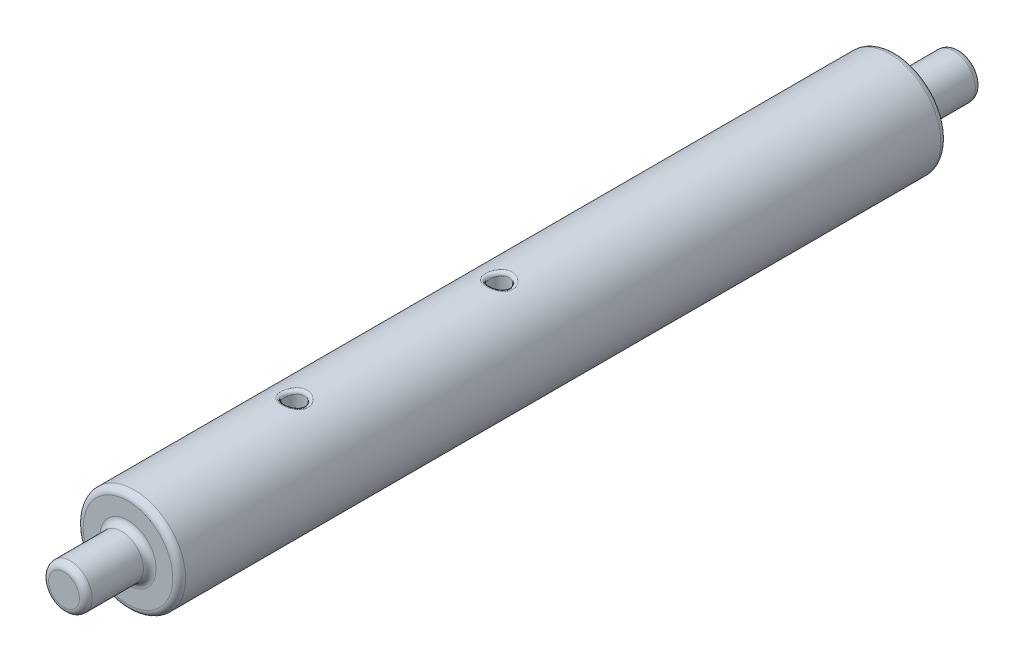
from build123d import *

# Parameters (mm, degrees)
FILLET_1_R          = 0.5
SKETCH_2_R          = 0.75
CUT_EXTRUDE_1_DEPTH = 5
FILLET_2_R          = 0.25


with BuildPart() as part:
    # Sketch 1 → Revolve 1 (revolve)
    with BuildSketch(Plane(origin=(0, 0, 0), x_dir=(0, 0, -1), z_dir=(1, 0, 0)), mode=Mode.PRIVATE) as revolve_1_sk:
        Polygon((-35, 0), (35, 0), (35, 1.7), (30, 1.7), (30, 4), (-30, 4), (-30, 1.7), (-35, 1.7), align=None)
    revolve(revolve_1_sk.sketch.rotate(Axis((0, 0, 35), (0, 0, -1)), 90), axis=Axis((0, 0, 35), (0, 0, -1)))

    # Fillet 1
    fillet_1_edges = [part.edges().sort_by_distance(p)[0] for p in [
        (-1.7, 0, 35),
        (-1.7, 0, 30),
        (-4, 0, 30),
        (-4, 0, -30),
        (-1.7, 0, -30),
        (-1.7, 0, -35),
    ]]
    fillet(fillet_1_edges, radius=FILLET_1_R)

    # Sketch 2 → Cut-Extrude 1 (cut, symmetric)
    with BuildSketch(Plane(origin=(0, 0, 0), x_dir=(1, 0, 0), z_dir=(0, 1, 0))):
        with Locations(Location((0, -17, 0), (0, 0, 270))):
            Circle(SKETCH_2_R)
        with Locations(Location((0, -1, 0), (0, 0, 270))):
            Circle(SKETCH_2_R)
    extrude(amount=CUT_EXTRUDE_1_DEPTH, both=True, mode=Mode.SUBTRACT)

    # Fillet 2
    fillet_2_edges = [part.edges().sort_by_distance(p)[0] for p in [
        (0, 4.000000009, 16.25000001),
        (0, -4, 16.25),
        (0, 4.000000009, 0.25000001),
        (0, -4, 0.25),
    ]]
    fillet(fillet_2_edges, radius=FILLET_2_R)


solid = part.part
